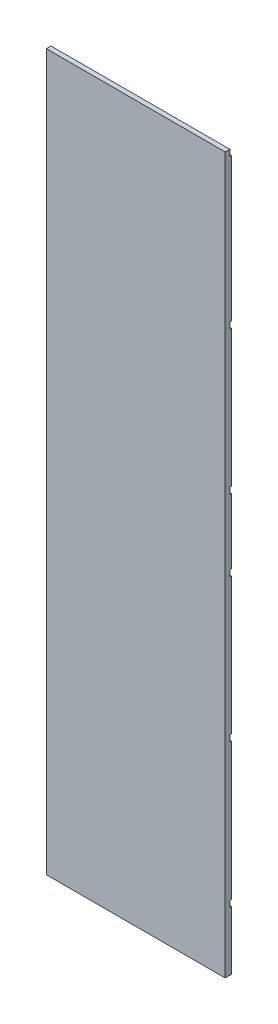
ISO-10303-21;
HEADER;
FILE_DESCRIPTION(('STEP AP214'),'2;1');
FILE_NAME('part.step','',(''),(''),'','','');
FILE_SCHEMA(('AUTOMOTIVE_DESIGN { 1 0 10303 214 1 1 1 1 }'));
ENDSEC;
DATA;
#1=APPLICATION_CONTEXT('core data for automotive mechanical design processes');
#2=APPLICATION_PROTOCOL_DEFINITION('international standard','automotive_design',2000,#1);
#3=PRODUCT_CONTEXT('',#1,'mechanical');
#4=PRODUCT('Part','Part','',(#3));
#5=PRODUCT_RELATED_PRODUCT_CATEGORY('part','',(#4));
#6=PRODUCT_DEFINITION_FORMATION('','',#4);
#7=PRODUCT_DEFINITION_CONTEXT('part definition',#1,'design');
#8=PRODUCT_DEFINITION('design','',#6,#7);
#9=PRODUCT_DEFINITION_SHAPE('','',#8);
#10=(LENGTH_UNIT() NAMED_UNIT(*) SI_UNIT(.MILLI.,.METRE.));
#11=(NAMED_UNIT(*) PLANE_ANGLE_UNIT() SI_UNIT($,.RADIAN.));
#12=(NAMED_UNIT(*) SI_UNIT($,.STERADIAN.) SOLID_ANGLE_UNIT());
#13=UNCERTAINTY_MEASURE_WITH_UNIT(LENGTH_MEASURE(1.E-05),#10,'distance_accuracy_value','');
#14=(GEOMETRIC_REPRESENTATION_CONTEXT(3) GLOBAL_UNCERTAINTY_ASSIGNED_CONTEXT((#13)) GLOBAL_UNIT_ASSIGNED_CONTEXT((#10,
#11,#12)) REPRESENTATION_CONTEXT('',''));
#15=CARTESIAN_POINT('',(0.,0.,0.));
#16=DIRECTION('',(0.,0.,1.));
#17=DIRECTION('',(1.,0.,0.));
#18=AXIS2_PLACEMENT_3D('',#15,#16,#17);
#19=CARTESIAN_POINT('',(0.,0.,1018.));
#20=DIRECTION('',(0.,0.,-1.));
#21=DIRECTION('',(1.,0.,0.));
#22=AXIS2_PLACEMENT_3D('',#19,#20,#21);
#23=PLANE('',#22);
#24=DIRECTION('',(0.999950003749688,0.00999950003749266,0.));
#25=VECTOR('',#24,1.);
#26=CARTESIAN_POINT('',(-249.999999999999,558.999999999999,1018.));
#27=LINE('',#26,#25);
#28=CARTESIAN_POINT('',(-249.999999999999,558.999999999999,1018.));
#29=VERTEX_POINT('',#28);
#30=CARTESIAN_POINT('',(250.000000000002,563.999999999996,1018.));
#31=VERTEX_POINT('',#30);
#32=EDGE_CURVE('E226',#29,#31,#27,.T.);
#33=ORIENTED_EDGE('',*,*,#32,.T.);
#34=DIRECTION('',(0.,1.,0.));
#35=VECTOR('',#34,1.);
#36=CARTESIAN_POINT('',(250.000000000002,1000.,1018.));
#37=LINE('',#36,#35);
#38=CARTESIAN_POINT('',(250.000000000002,181.999999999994,1018.));
#39=VERTEX_POINT('',#38);
#40=EDGE_CURVE('E440',#39,#31,#37,.T.);
#41=ORIENTED_EDGE('',*,*,#40,.F.);
#42=DIRECTION('',(-0.999950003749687,-0.00999950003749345,0.));
#43=VECTOR('',#42,1.);
#44=CARTESIAN_POINT('',(250.000000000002,181.999999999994,1018.));
#45=LINE('',#44,#43);
#46=CARTESIAN_POINT('',(-249.999999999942,176.999999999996,1018.));
#47=VERTEX_POINT('',#46);
#48=EDGE_CURVE('E250',#39,#47,#45,.T.);
#49=ORIENTED_EDGE('',*,*,#48,.T.);
#50=DIRECTION('',(0.,-1.,0.));
#51=VECTOR('',#50,1.);
#52=CARTESIAN_POINT('',(-249.999999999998,1000.,1018.));
#53=LINE('',#52,#51);
#54=EDGE_CURVE('E355',#29,#47,#53,.T.);
#55=ORIENTED_EDGE('',*,*,#54,.F.);
#56=EDGE_LOOP('',(#33,#41,#49,#55));
#57=FACE_BOUND('',#56,.T.);
#58=ADVANCED_FACE('F32',(#57),#23,.T.);
#59=DIRECTION('',(0.999950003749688,0.00999950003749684,0.));
#60=VECTOR('',#59,1.);
#61=CARTESIAN_POINT('',(-249.999999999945,158.999999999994,1018.));
#62=LINE('',#61,#60);
#63=CARTESIAN_POINT('',(-249.999999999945,158.999999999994,1018.));
#64=VERTEX_POINT('',#63);
#65=CARTESIAN_POINT('',(250.000000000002,163.999999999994,1018.));
#66=VERTEX_POINT('',#65);
#67=EDGE_CURVE('E243',#64,#66,#62,.T.);
#68=ORIENTED_EDGE('',*,*,#67,.T.);
#69=CARTESIAN_POINT('',(250.000000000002,-18.0000000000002,1018.));
#70=VERTEX_POINT('',#69);
#71=EDGE_CURVE('E438',#70,#66,#37,.T.);
#72=ORIENTED_EDGE('',*,*,#71,.F.);
#73=DIRECTION('',(-0.999950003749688,-0.00999950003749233,0.));
#74=VECTOR('',#73,1.);
#75=CARTESIAN_POINT('',(250.000000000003,-18.0000000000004,1018.));
#76=LINE('',#75,#74);
#77=CARTESIAN_POINT('',(-249.999999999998,-22.9999999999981,1018.));
#78=VERTEX_POINT('',#77);
#79=EDGE_CURVE('E274',#70,#78,#76,.T.);
#80=ORIENTED_EDGE('',*,*,#79,.T.);
#81=EDGE_CURVE('E464',#64,#78,#53,.T.);
#82=ORIENTED_EDGE('',*,*,#81,.F.);
#83=EDGE_LOOP('',(#68,#72,#80,#82));
#84=FACE_BOUND('',#83,.T.);
#85=ADVANCED_FACE('F479',(#84),#23,.T.);
#86=DIRECTION('',(0.999950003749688,0.00999950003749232,0.));
#87=VECTOR('',#86,1.);
#88=CARTESIAN_POINT('',(-249.999999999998,-40.9999999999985,1018.));
#89=LINE('',#88,#87);
#90=CARTESIAN_POINT('',(-249.999999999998,-40.9999999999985,1018.));
#91=VERTEX_POINT('',#90);
#92=CARTESIAN_POINT('',(250.000000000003,-36.0000000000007,1018.));
#93=VERTEX_POINT('',#92);
#94=EDGE_CURVE('E266',#91,#93,#89,.T.);
#95=ORIENTED_EDGE('',*,*,#94,.T.);
#96=CARTESIAN_POINT('',(250.000000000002,-418.000000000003,1018.));
#97=VERTEX_POINT('',#96);
#98=EDGE_CURVE('E413',#97,#93,#37,.T.);
#99=ORIENTED_EDGE('',*,*,#98,.F.);
#100=DIRECTION('',(-0.999950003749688,-0.0099995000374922,0.));
#101=VECTOR('',#100,1.);
#102=CARTESIAN_POINT('',(250.000000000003,-418.000000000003,1018.));
#103=LINE('',#102,#101);
#104=CARTESIAN_POINT('',(-249.999999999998,-423.000000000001,1018.));
#105=VERTEX_POINT('',#104);
#106=EDGE_CURVE('E298',#97,#105,#103,.T.);
#107=ORIENTED_EDGE('',*,*,#106,.T.);
#108=EDGE_CURVE('E704',#91,#105,#53,.T.);
#109=ORIENTED_EDGE('',*,*,#108,.F.);
#110=EDGE_LOOP('',(#95,#99,#107,#109));
#111=FACE_BOUND('',#110,.T.);
#112=ADVANCED_FACE('F436',(#111),#23,.T.);
#113=DIRECTION('',(0.999950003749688,0.0099995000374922,0.));
#114=VECTOR('',#113,1.);
#115=CARTESIAN_POINT('',(-249.999999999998,-441.000000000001,1018.));
#116=LINE('',#115,#114);
#117=CARTESIAN_POINT('',(-249.999999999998,-441.000000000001,1018.));
#118=VERTEX_POINT('',#117);
#119=CARTESIAN_POINT('',(250.000000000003,-436.000000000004,1018.));
#120=VERTEX_POINT('',#119);
#121=EDGE_CURVE('E290',#118,#120,#116,.T.);
#122=ORIENTED_EDGE('',*,*,#121,.T.);
#123=CARTESIAN_POINT('',(250.000000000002,-818.000000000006,1018.));
#124=VERTEX_POINT('',#123);
#125=EDGE_CURVE('E364',#124,#120,#37,.T.);
#126=ORIENTED_EDGE('',*,*,#125,.F.);
#127=DIRECTION('',(-0.999950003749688,-0.00999950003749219,0.));
#128=VECTOR('',#127,1.);
#129=CARTESIAN_POINT('',(250.000000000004,-818.000000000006,1018.));
#130=LINE('',#129,#128);
#131=CARTESIAN_POINT('',(-249.999999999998,-823.000000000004,1018.));
#132=VERTEX_POINT('',#131);
#133=EDGE_CURVE('E322',#124,#132,#130,.T.);
#134=ORIENTED_EDGE('',*,*,#133,.T.);
#135=EDGE_CURVE('E395',#118,#132,#53,.T.);
#136=ORIENTED_EDGE('',*,*,#135,.F.);
#137=EDGE_LOOP('',(#122,#126,#134,#136));
#138=FACE_BOUND('',#137,.T.);
#139=ADVANCED_FACE('F416',(#138),#23,.T.);
#140=DIRECTION('',(0.999950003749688,0.00999950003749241,0.));
#141=VECTOR('',#140,1.);
#142=CARTESIAN_POINT('',(-249.999999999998,-841.000000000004,1018.));
#143=LINE('',#142,#141);
#144=CARTESIAN_POINT('',(-249.999999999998,-841.000000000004,1018.));
#145=VERTEX_POINT('',#144);
#146=CARTESIAN_POINT('',(250.000000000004,-836.000000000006,1018.));
#147=VERTEX_POINT('',#146);
#148=EDGE_CURVE('E314',#145,#147,#143,.T.);
#149=ORIENTED_EDGE('',*,*,#148,.T.);
#150=CARTESIAN_POINT('',(250.000000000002,-1000.,1018.));
#151=VERTEX_POINT('',#150);
#152=EDGE_CURVE('E360',#151,#147,#37,.T.);
#153=ORIENTED_EDGE('',*,*,#152,.F.);
#154=DIRECTION('',(1.,0.,0.));
#155=VECTOR('',#154,1.);
#156=CARTESIAN_POINT('',(-249.999999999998,-1000.,1018.));
#157=LINE('',#156,#155);
#158=CARTESIAN_POINT('',(-249.999999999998,-1000.,1018.));
#159=VERTEX_POINT('',#158);
#160=EDGE_CURVE('E354',#159,#151,#157,.T.);
#161=ORIENTED_EDGE('',*,*,#160,.F.);
#162=EDGE_CURVE('E356',#145,#159,#53,.T.);
#163=ORIENTED_EDGE('',*,*,#162,.F.);
#164=EDGE_LOOP('',(#149,#153,#161,#163));
#165=FACE_BOUND('',#164,.T.);
#166=ADVANCED_FACE('F396',(#165),#23,.T.);
#167=CARTESIAN_POINT('',(-249.999999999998,1000.,1018.));
#168=DIRECTION('',(0.,-1.,0.));
#169=DIRECTION('',(0.,0.,1.));
#170=AXIS2_PLACEMENT_3D('',#167,#168,#169);
#171=PLANE('',#170);
#172=DIRECTION('',(-1.,0.,0.));
#173=VECTOR('',#172,1.);
#174=CARTESIAN_POINT('',(250.000000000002,1000.,1023.));
#175=LINE('',#174,#173);
#176=CARTESIAN_POINT('',(250.000000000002,1000.,1023.));
#177=VERTEX_POINT('',#176);
#178=CARTESIAN_POINT('',(-249.999999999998,1000.,1023.));
#179=VERTEX_POINT('',#178);
#180=EDGE_CURVE('E335',#177,#179,#175,.T.);
#181=ORIENTED_EDGE('',*,*,#180,.T.);
#182=DIRECTION('',(0.,0.,1.));
#183=VECTOR('',#182,1.);
#184=CARTESIAN_POINT('',(-249.999999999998,1000.,1018.));
#185=LINE('',#184,#183);
#186=CARTESIAN_POINT('',(-249.999999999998,1000.,1036.));
#187=VERTEX_POINT('',#186);
#188=EDGE_CURVE('E363',#179,#187,#185,.T.);
#189=ORIENTED_EDGE('',*,*,#188,.T.);
#190=DIRECTION('',(-1.,0.,0.));
#191=VECTOR('',#190,1.);
#192=CARTESIAN_POINT('',(-249.999999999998,1000.,1036.));
#193=LINE('',#192,#191);
#194=CARTESIAN_POINT('',(250.000000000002,1000.,1036.));
#195=VERTEX_POINT('',#194);
#196=EDGE_CURVE('E372',#195,#187,#193,.T.);
#197=ORIENTED_EDGE('',*,*,#196,.F.);
#198=DIRECTION('',(0.,0.,1.));
#199=VECTOR('',#198,1.);
#200=CARTESIAN_POINT('',(250.000000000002,1000.,1018.));
#201=LINE('',#200,#199);
#202=EDGE_CURVE('E377',#177,#195,#201,.T.);
#203=ORIENTED_EDGE('',*,*,#202,.F.);
#204=EDGE_LOOP('',(#181,#189,#197,#203));
#205=FACE_BOUND('',#204,.T.);
#206=ADVANCED_FACE('F457',(#205),#171,.F.);
#207=CARTESIAN_POINT('',(-249.999999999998,1000.,1018.));
#208=DIRECTION('',(1.,0.,0.));
#209=DIRECTION('',(0.,0.,1.));
#210=AXIS2_PLACEMENT_3D('',#207,#208,#209);
#211=PLANE('',#210);
#212=ORIENTED_EDGE('',*,*,#54,.T.);
#213=DIRECTION('',(0.,0.,-1.));
#214=VECTOR('',#213,1.);
#215=CARTESIAN_POINT('',(-249.999999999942,176.999999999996,1023.));
#216=LINE('',#215,#214);
#217=CARTESIAN_POINT('',(-249.999999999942,176.999999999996,1023.));
#218=VERTEX_POINT('',#217);
#219=EDGE_CURVE('E259',#218,#47,#216,.T.);
#220=ORIENTED_EDGE('',*,*,#219,.F.);
#221=DIRECTION('',(-1.54197642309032E-13,-1.,0.));
#222=VECTOR('',#221,1.);
#223=CARTESIAN_POINT('',(-249.999999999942,176.999999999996,1023.));
#224=LINE('',#223,#222);
#225=CARTESIAN_POINT('',(-249.999999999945,158.999999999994,1023.));
#226=VERTEX_POINT('',#225);
#227=EDGE_CURVE('E245',#218,#226,#224,.T.);
#228=ORIENTED_EDGE('',*,*,#227,.T.);
#229=DIRECTION('',(0.,0.,-1.));
#230=VECTOR('',#229,1.);
#231=CARTESIAN_POINT('',(-249.999999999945,158.999999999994,1023.));
#232=LINE('',#231,#230);
#233=EDGE_CURVE('E257',#226,#64,#232,.T.);
#234=ORIENTED_EDGE('',*,*,#233,.T.);
#235=ORIENTED_EDGE('',*,*,#81,.T.);
#236=DIRECTION('',(0.,0.,-1.));
#237=VECTOR('',#236,1.);
#238=CARTESIAN_POINT('',(-249.999999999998,-22.9999999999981,1023.));
#239=LINE('',#238,#237);
#240=CARTESIAN_POINT('',(-249.999999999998,-22.9999999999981,1023.));
#241=VERTEX_POINT('',#240);
#242=EDGE_CURVE('E283',#241,#78,#239,.T.);
#243=ORIENTED_EDGE('',*,*,#242,.F.);
#244=DIRECTION('',(0.,-1.,0.));
#245=VECTOR('',#244,1.);
#246=CARTESIAN_POINT('',(-249.999999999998,-22.9999999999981,1023.));
#247=LINE('',#246,#245);
#248=CARTESIAN_POINT('',(-249.999999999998,-40.9999999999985,1023.));
#249=VERTEX_POINT('',#248);
#250=EDGE_CURVE('E268',#241,#249,#247,.T.);
#251=ORIENTED_EDGE('',*,*,#250,.T.);
#252=DIRECTION('',(0.,0.,-1.));
#253=VECTOR('',#252,1.);
#254=CARTESIAN_POINT('',(-249.999999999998,-40.9999999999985,1023.));
#255=LINE('',#254,#253);
#256=EDGE_CURVE('E281',#249,#91,#255,.T.);
#257=ORIENTED_EDGE('',*,*,#256,.T.);
#258=ORIENTED_EDGE('',*,*,#108,.T.);
#259=DIRECTION('',(0.,0.,-1.));
#260=VECTOR('',#259,1.);
#261=CARTESIAN_POINT('',(-249.999999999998,-423.000000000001,1023.));
#262=LINE('',#261,#260);
#263=CARTESIAN_POINT('',(-249.999999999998,-423.000000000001,1023.));
#264=VERTEX_POINT('',#263);
#265=EDGE_CURVE('E307',#264,#105,#262,.T.);
#266=ORIENTED_EDGE('',*,*,#265,.F.);
#267=DIRECTION('',(0.,-1.,0.));
#268=VECTOR('',#267,1.);
#269=CARTESIAN_POINT('',(-249.999999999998,-423.000000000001,1023.));
#270=LINE('',#269,#268);
#271=CARTESIAN_POINT('',(-249.999999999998,-441.000000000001,1023.));
#272=VERTEX_POINT('',#271);
#273=EDGE_CURVE('E292',#264,#272,#270,.T.);
#274=ORIENTED_EDGE('',*,*,#273,.T.);
#275=DIRECTION('',(0.,0.,-1.));
#276=VECTOR('',#275,1.);
#277=CARTESIAN_POINT('',(-249.999999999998,-441.000000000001,1023.));
#278=LINE('',#277,#276);
#279=EDGE_CURVE('E305',#272,#118,#278,.T.);
#280=ORIENTED_EDGE('',*,*,#279,.T.);
#281=ORIENTED_EDGE('',*,*,#135,.T.);
#282=DIRECTION('',(0.,0.,-1.));
#283=VECTOR('',#282,1.);
#284=CARTESIAN_POINT('',(-249.999999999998,-823.000000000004,1023.));
#285=LINE('',#284,#283);
#286=CARTESIAN_POINT('',(-249.999999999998,-823.000000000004,1023.));
#287=VERTEX_POINT('',#286);
#288=EDGE_CURVE('E330',#287,#132,#285,.T.);
#289=ORIENTED_EDGE('',*,*,#288,.F.);
#290=DIRECTION('',(0.,-1.,0.));
#291=VECTOR('',#290,1.);
#292=CARTESIAN_POINT('',(-249.999999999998,-823.000000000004,1023.));
#293=LINE('',#292,#291);
#294=CARTESIAN_POINT('',(-249.999999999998,-841.000000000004,1023.));
#295=VERTEX_POINT('',#294);
#296=EDGE_CURVE('E316',#287,#295,#293,.T.);
#297=ORIENTED_EDGE('',*,*,#296,.T.);
#298=DIRECTION('',(0.,0.,-1.));
#299=VECTOR('',#298,1.);
#300=CARTESIAN_POINT('',(-249.999999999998,-841.000000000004,1023.));
#301=LINE('',#300,#299);
#302=EDGE_CURVE('E328',#295,#145,#301,.T.);
#303=ORIENTED_EDGE('',*,*,#302,.T.);
#304=ORIENTED_EDGE('',*,*,#162,.T.);
#305=DIRECTION('',(0.,0.,1.));
#306=VECTOR('',#305,1.);
#307=CARTESIAN_POINT('',(-249.999999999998,-1000.,1018.));
#308=LINE('',#307,#306);
#309=CARTESIAN_POINT('',(-249.999999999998,-1000.,1036.));
#310=VERTEX_POINT('',#309);
#311=EDGE_CURVE('E11',#159,#310,#308,.T.);
#312=ORIENTED_EDGE('',*,*,#311,.T.);
#313=DIRECTION('',(0.,-1.,0.));
#314=VECTOR('',#313,1.);
#315=CARTESIAN_POINT('',(-249.999999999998,1000.,1036.));
#316=LINE('',#315,#314);
#317=EDGE_CURVE('E348',#187,#310,#316,.T.);
#318=ORIENTED_EDGE('',*,*,#317,.F.);
#319=ORIENTED_EDGE('',*,*,#188,.F.);
#320=DIRECTION('',(0.,-1.,0.));
#321=VECTOR('',#320,1.);
#322=CARTESIAN_POINT('',(-249.999999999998,1000.,1023.));
#323=LINE('',#322,#321);
#324=CARTESIAN_POINT('',(-249.999999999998,982.,1023.));
#325=VERTEX_POINT('',#324);
#326=EDGE_CURVE('E338',#179,#325,#323,.T.);
#327=ORIENTED_EDGE('',*,*,#326,.T.);
#328=DIRECTION('',(0.,0.,-1.));
#329=VECTOR('',#328,1.);
#330=CARTESIAN_POINT('',(-249.999999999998,982.,1023.));
#331=LINE('',#330,#329);
#332=CARTESIAN_POINT('',(-249.999999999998,982.,1018.));
#333=VERTEX_POINT('',#332);
#334=EDGE_CURVE('E343',#325,#333,#331,.T.);
#335=ORIENTED_EDGE('',*,*,#334,.T.);
#336=CARTESIAN_POINT('',(-249.999999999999,576.999999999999,1018.));
#337=VERTEX_POINT('',#336);
#338=EDGE_CURVE('E351',#333,#337,#53,.T.);
#339=ORIENTED_EDGE('',*,*,#338,.T.);
#340=DIRECTION('',(0.,0.,-1.));
#341=VECTOR('',#340,1.);
#342=CARTESIAN_POINT('',(-249.999999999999,576.999999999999,1023.));
#343=LINE('',#342,#341);
#344=CARTESIAN_POINT('',(-249.999999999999,576.999999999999,1023.));
#345=VERTEX_POINT('',#344);
#346=EDGE_CURVE('E220',#345,#337,#343,.T.);
#347=ORIENTED_EDGE('',*,*,#346,.F.);
#348=DIRECTION('',(0.,-1.,0.));
#349=VECTOR('',#348,1.);
#350=CARTESIAN_POINT('',(-249.999999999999,576.999999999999,1023.));
#351=LINE('',#350,#349);
#352=CARTESIAN_POINT('',(-249.999999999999,558.999999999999,1023.));
#353=VERTEX_POINT('',#352);
#354=EDGE_CURVE('E213',#345,#353,#351,.T.);
#355=ORIENTED_EDGE('',*,*,#354,.T.);
#356=DIRECTION('',(0.,0.,-1.));
#357=VECTOR('',#356,1.);
#358=CARTESIAN_POINT('',(-249.999999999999,558.999999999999,1023.));
#359=LINE('',#358,#357);
#360=EDGE_CURVE('E237',#353,#29,#359,.T.);
#361=ORIENTED_EDGE('',*,*,#360,.T.);
#362=EDGE_LOOP('',(#212,#220,#228,#234,#235,#243,#251,#257,#258,#266,#274,#280,#281,#289,#297,
#303,#304,#312,#318,#319,#327,#335,#339,#347,#355,#361));
#363=FACE_BOUND('',#362,.T.);
#364=ADVANCED_FACE('F34',(#363),#211,.F.);
#365=CARTESIAN_POINT('',(-249.999999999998,-1000.,1018.));
#366=DIRECTION('',(0.,1.,0.));
#367=DIRECTION('',(0.,0.,-1.));
#368=AXIS2_PLACEMENT_3D('',#365,#366,#367);
#369=PLANE('',#368);
#370=DIRECTION('',(1.,0.,0.));
#371=VECTOR('',#370,1.);
#372=CARTESIAN_POINT('',(-249.999999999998,-1000.,1036.));
#373=LINE('',#372,#371);
#374=CARTESIAN_POINT('',(250.000000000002,-1000.,1036.));
#375=VERTEX_POINT('',#374);
#376=EDGE_CURVE('E367',#310,#375,#373,.T.);
#377=ORIENTED_EDGE('',*,*,#376,.F.);
#378=ORIENTED_EDGE('',*,*,#311,.F.);
#379=ORIENTED_EDGE('',*,*,#160,.T.);
#380=DIRECTION('',(0.,0.,1.));
#381=VECTOR('',#380,1.);
#382=CARTESIAN_POINT('',(250.000000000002,-1000.,1018.));
#383=LINE('',#382,#381);
#384=EDGE_CURVE('E40',#151,#375,#383,.T.);
#385=ORIENTED_EDGE('',*,*,#384,.T.);
#386=EDGE_LOOP('',(#377,#378,#379,#385));
#387=FACE_BOUND('',#386,.T.);
#388=ADVANCED_FACE('F381',(#387),#369,.F.);
#389=CARTESIAN_POINT('',(250.000000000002,1000.,1018.));
#390=DIRECTION('',(-1.,0.,0.));
#391=DIRECTION('',(0.,0.,-1.));
#392=AXIS2_PLACEMENT_3D('',#389,#390,#391);
#393=PLANE('',#392);
#394=DIRECTION('',(0.,1.,0.));
#395=VECTOR('',#394,1.);
#396=CARTESIAN_POINT('',(250.000000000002,563.999999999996,1023.));
#397=LINE('',#396,#395);
#398=CARTESIAN_POINT('',(250.000000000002,563.999999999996,1023.));
#399=VERTEX_POINT('',#398);
#400=CARTESIAN_POINT('',(250.000000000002,581.999999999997,1023.));
#401=VERTEX_POINT('',#400);
#402=EDGE_CURVE('E211',#399,#401,#397,.T.);
#403=ORIENTED_EDGE('',*,*,#402,.T.);
#404=DIRECTION('',(0.,0.,-1.));
#405=VECTOR('',#404,1.);
#406=CARTESIAN_POINT('',(250.000000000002,581.999999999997,1023.));
#407=LINE('',#406,#405);
#408=CARTESIAN_POINT('',(250.000000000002,581.999999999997,1018.));
#409=VERTEX_POINT('',#408);
#410=EDGE_CURVE('E217',#401,#409,#407,.T.);
#411=ORIENTED_EDGE('',*,*,#410,.T.);
#412=CARTESIAN_POINT('',(250.000000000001,982.,1018.));
#413=VERTEX_POINT('',#412);
#414=EDGE_CURVE('E359',#409,#413,#37,.T.);
#415=ORIENTED_EDGE('',*,*,#414,.T.);
#416=DIRECTION('',(0.,0.,-1.));
#417=VECTOR('',#416,1.);
#418=CARTESIAN_POINT('',(250.000000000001,982.,1023.));
#419=LINE('',#418,#417);
#420=CARTESIAN_POINT('',(250.000000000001,982.,1023.));
#421=VERTEX_POINT('',#420);
#422=EDGE_CURVE('E345',#421,#413,#419,.T.);
#423=ORIENTED_EDGE('',*,*,#422,.F.);
#424=DIRECTION('',(0.,1.,0.));
#425=VECTOR('',#424,1.);
#426=CARTESIAN_POINT('',(250.000000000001,982.,1023.));
#427=LINE('',#426,#425);
#428=EDGE_CURVE('E333',#421,#177,#427,.T.);
#429=ORIENTED_EDGE('',*,*,#428,.T.);
#430=ORIENTED_EDGE('',*,*,#202,.T.);
#431=DIRECTION('',(0.,1.,0.));
#432=VECTOR('',#431,1.);
#433=CARTESIAN_POINT('',(250.000000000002,1000.,1036.));
#434=LINE('',#433,#432);
#435=EDGE_CURVE('E370',#375,#195,#434,.T.);
#436=ORIENTED_EDGE('',*,*,#435,.F.);
#437=ORIENTED_EDGE('',*,*,#384,.F.);
#438=ORIENTED_EDGE('',*,*,#152,.T.);
#439=DIRECTION('',(0.,0.,-1.));
#440=VECTOR('',#439,1.);
#441=CARTESIAN_POINT('',(250.000000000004,-836.000000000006,1023.));
#442=LINE('',#441,#440);
#443=CARTESIAN_POINT('',(250.000000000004,-836.000000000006,1023.));
#444=VERTEX_POINT('',#443);
#445=EDGE_CURVE('E301',#444,#147,#442,.T.);
#446=ORIENTED_EDGE('',*,*,#445,.F.);
#447=DIRECTION('',(0.,1.,0.));
#448=VECTOR('',#447,1.);
#449=CARTESIAN_POINT('',(250.000000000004,-836.000000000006,1023.));
#450=LINE('',#449,#448);
#451=CARTESIAN_POINT('',(250.000000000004,-818.000000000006,1023.));
#452=VERTEX_POINT('',#451);
#453=EDGE_CURVE('E310',#444,#452,#450,.T.);
#454=ORIENTED_EDGE('',*,*,#453,.T.);
#455=DIRECTION('',(0.,0.,-1.));
#456=VECTOR('',#455,1.);
#457=CARTESIAN_POINT('',(250.000000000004,-818.000000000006,1023.));
#458=LINE('',#457,#456);
#459=EDGE_CURVE('E321',#452,#124,#458,.T.);
#460=ORIENTED_EDGE('',*,*,#459,.T.);
#461=ORIENTED_EDGE('',*,*,#125,.T.);
#462=DIRECTION('',(0.,0.,-1.));
#463=VECTOR('',#462,1.);
#464=CARTESIAN_POINT('',(250.000000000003,-436.000000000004,1023.));
#465=LINE('',#464,#463);
#466=CARTESIAN_POINT('',(250.000000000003,-436.000000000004,1023.));
#467=VERTEX_POINT('',#466);
#468=EDGE_CURVE('E277',#467,#120,#465,.T.);
#469=ORIENTED_EDGE('',*,*,#468,.F.);
#470=DIRECTION('',(0.,1.,0.));
#471=VECTOR('',#470,1.);
#472=CARTESIAN_POINT('',(250.000000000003,-436.000000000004,1023.));
#473=LINE('',#472,#471);
#474=CARTESIAN_POINT('',(250.000000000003,-418.000000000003,1023.));
#475=VERTEX_POINT('',#474);
#476=EDGE_CURVE('E286',#467,#475,#473,.T.);
#477=ORIENTED_EDGE('',*,*,#476,.T.);
#478=DIRECTION('',(0.,0.,-1.));
#479=VECTOR('',#478,1.);
#480=CARTESIAN_POINT('',(250.000000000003,-418.000000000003,1023.));
#481=LINE('',#480,#479);
#482=EDGE_CURVE('E297',#475,#97,#481,.T.);
#483=ORIENTED_EDGE('',*,*,#482,.T.);
#484=ORIENTED_EDGE('',*,*,#98,.T.);
#485=DIRECTION('',(0.,0.,-1.));
#486=VECTOR('',#485,1.);
#487=CARTESIAN_POINT('',(250.000000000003,-36.0000000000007,1023.));
#488=LINE('',#487,#486);
#489=CARTESIAN_POINT('',(250.000000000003,-36.0000000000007,1023.));
#490=VERTEX_POINT('',#489);
#491=EDGE_CURVE('E253',#490,#93,#488,.T.);
#492=ORIENTED_EDGE('',*,*,#491,.F.);
#493=DIRECTION('',(0.,1.,0.));
#494=VECTOR('',#493,1.);
#495=CARTESIAN_POINT('',(250.000000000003,-36.0000000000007,1023.));
#496=LINE('',#495,#494);
#497=CARTESIAN_POINT('',(250.000000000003,-18.0000000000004,1023.));
#498=VERTEX_POINT('',#497);
#499=EDGE_CURVE('E262',#490,#498,#496,.T.);
#500=ORIENTED_EDGE('',*,*,#499,.T.);
#501=DIRECTION('',(0.,0.,-1.));
#502=VECTOR('',#501,1.);
#503=CARTESIAN_POINT('',(250.000000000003,-18.0000000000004,1023.));
#504=LINE('',#503,#502);
#505=EDGE_CURVE('E273',#498,#70,#504,.T.);
#506=ORIENTED_EDGE('',*,*,#505,.T.);
#507=ORIENTED_EDGE('',*,*,#71,.T.);
#508=DIRECTION('',(0.,0.,-1.));
#509=VECTOR('',#508,1.);
#510=CARTESIAN_POINT('',(250.000000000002,163.999999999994,1023.));
#511=LINE('',#510,#509);
#512=CARTESIAN_POINT('',(250.000000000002,163.999999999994,1023.));
#513=VERTEX_POINT('',#512);
#514=EDGE_CURVE('E233',#513,#66,#511,.T.);
#515=ORIENTED_EDGE('',*,*,#514,.F.);
#516=DIRECTION('',(0.,1.,0.));
#517=VECTOR('',#516,1.);
#518=CARTESIAN_POINT('',(250.000000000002,163.999999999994,1023.));
#519=LINE('',#518,#517);
#520=CARTESIAN_POINT('',(250.000000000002,181.999999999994,1023.));
#521=VERTEX_POINT('',#520);
#522=EDGE_CURVE('E240',#513,#521,#519,.T.);
#523=ORIENTED_EDGE('',*,*,#522,.T.);
#524=DIRECTION('',(0.,0.,-1.));
#525=VECTOR('',#524,1.);
#526=CARTESIAN_POINT('',(250.000000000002,181.999999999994,1023.));
#527=LINE('',#526,#525);
#528=EDGE_CURVE('E55',#521,#39,#527,.T.);
#529=ORIENTED_EDGE('',*,*,#528,.T.);
#530=ORIENTED_EDGE('',*,*,#40,.T.);
#531=DIRECTION('',(0.,0.,-1.));
#532=VECTOR('',#531,1.);
#533=CARTESIAN_POINT('',(250.000000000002,563.999999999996,1023.));
#534=LINE('',#533,#532);
#535=EDGE_CURVE('E225',#399,#31,#534,.T.);
#536=ORIENTED_EDGE('',*,*,#535,.F.);
#537=EDGE_LOOP('',(#403,#411,#415,#423,#429,#430,#436,#437,#438,#446,#454,#460,#461,#469,#477,
#483,#484,#492,#500,#506,#507,#515,#523,#529,#530,#536));
#538=FACE_BOUND('',#537,.T.);
#539=ADVANCED_FACE('F224',(#538),#393,.F.);
#540=DIRECTION('',(-0.999950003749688,-0.00999950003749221,0.));
#541=VECTOR('',#540,1.);
#542=CARTESIAN_POINT('',(250.000000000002,581.999999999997,1018.));
#543=LINE('',#542,#541);
#544=EDGE_CURVE('E47',#409,#337,#543,.T.);
#545=ORIENTED_EDGE('',*,*,#544,.T.);
#546=ORIENTED_EDGE('',*,*,#338,.F.);
#547=DIRECTION('',(1.,0.,0.));
#548=VECTOR('',#547,1.);
#549=CARTESIAN_POINT('',(-249.999999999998,982.,1018.));
#550=LINE('',#549,#548);
#551=EDGE_CURVE('E236',#333,#413,#550,.T.);
#552=ORIENTED_EDGE('',*,*,#551,.T.);
#553=ORIENTED_EDGE('',*,*,#414,.F.);
#554=EDGE_LOOP('',(#545,#546,#552,#553));
#555=FACE_BOUND('',#554,.T.);
#556=ADVANCED_FACE('F446',(#555),#23,.T.);
#557=CARTESIAN_POINT('',(0.,0.,1036.));
#558=DIRECTION('',(0.,0.,-1.));
#559=DIRECTION('',(1.,0.,0.));
#560=AXIS2_PLACEMENT_3D('',#557,#558,#559);
#561=PLANE('',#560);
#562=ORIENTED_EDGE('',*,*,#317,.T.);
#563=ORIENTED_EDGE('',*,*,#376,.T.);
#564=ORIENTED_EDGE('',*,*,#435,.T.);
#565=ORIENTED_EDGE('',*,*,#196,.T.);
#566=EDGE_LOOP('',(#562,#563,#564,#565));
#567=FACE_BOUND('',#566,.T.);
#568=ADVANCED_FACE('F385',(#567),#561,.F.);
#569=CARTESIAN_POINT('',(-249.999999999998,982.,1023.));
#570=DIRECTION('',(0.,-1.,0.));
#571=DIRECTION('',(0.,0.,1.));
#572=AXIS2_PLACEMENT_3D('',#569,#570,#571);
#573=PLANE('',#572);
#574=ORIENTED_EDGE('',*,*,#551,.F.);
#575=ORIENTED_EDGE('',*,*,#334,.F.);
#576=DIRECTION('',(1.,0.,0.));
#577=VECTOR('',#576,1.);
#578=CARTESIAN_POINT('',(-249.999999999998,982.,1023.));
#579=LINE('',#578,#577);
#580=EDGE_CURVE('E341',#325,#421,#579,.T.);
#581=ORIENTED_EDGE('',*,*,#580,.T.);
#582=ORIENTED_EDGE('',*,*,#422,.T.);
#583=EDGE_LOOP('',(#574,#575,#581,#582));
#584=FACE_BOUND('',#583,.T.);
#585=ADVANCED_FACE('F450',(#584),#573,.F.);
#586=CARTESIAN_POINT('',(0.,0.,1023.));
#587=DIRECTION('',(0.,0.,-1.));
#588=DIRECTION('',(1.,0.,0.));
#589=AXIS2_PLACEMENT_3D('',#586,#587,#588);
#590=PLANE('',#589);
#591=ORIENTED_EDGE('',*,*,#428,.F.);
#592=ORIENTED_EDGE('',*,*,#580,.F.);
#593=ORIENTED_EDGE('',*,*,#326,.F.);
#594=ORIENTED_EDGE('',*,*,#180,.F.);
#595=EDGE_LOOP('',(#591,#592,#593,#594));
#596=FACE_BOUND('',#595,.T.);
#597=ADVANCED_FACE('F454',(#596),#590,.T.);
#598=CARTESIAN_POINT('',(-249.999999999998,-841.000000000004,1023.));
#599=DIRECTION('',(0.00999950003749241,-0.999950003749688,0.));
#600=DIRECTION('',(0.999950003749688,0.00999950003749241,0.));
#601=AXIS2_PLACEMENT_3D('',#598,#599,#600);
#602=PLANE('',#601);
#603=ORIENTED_EDGE('',*,*,#148,.F.);
#604=ORIENTED_EDGE('',*,*,#302,.F.);
#605=DIRECTION('',(0.999950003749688,0.00999950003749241,0.));
#606=VECTOR('',#605,1.);
#607=CARTESIAN_POINT('',(-249.999999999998,-841.000000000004,1023.));
#608=LINE('',#607,#606);
#609=EDGE_CURVE('E319',#295,#444,#608,.T.);
#610=ORIENTED_EDGE('',*,*,#609,.T.);
#611=ORIENTED_EDGE('',*,*,#445,.T.);
#612=EDGE_LOOP('',(#603,#604,#610,#611));
#613=FACE_BOUND('',#612,.T.);
#614=ADVANCED_FACE('F400',(#613),#602,.F.);
#615=CARTESIAN_POINT('',(250.000000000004,-818.000000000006,1023.));
#616=DIRECTION('',(-0.00999950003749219,0.999950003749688,0.));
#617=DIRECTION('',(-0.999950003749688,-0.00999950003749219,0.));
#618=AXIS2_PLACEMENT_3D('',#615,#616,#617);
#619=PLANE('',#618);
#620=ORIENTED_EDGE('',*,*,#133,.F.);
#621=ORIENTED_EDGE('',*,*,#459,.F.);
#622=DIRECTION('',(-0.999950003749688,-0.00999950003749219,0.));
#623=VECTOR('',#622,1.);
#624=CARTESIAN_POINT('',(250.000000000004,-818.000000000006,1023.));
#625=LINE('',#624,#623);
#626=EDGE_CURVE('E313',#452,#287,#625,.T.);
#627=ORIENTED_EDGE('',*,*,#626,.T.);
#628=ORIENTED_EDGE('',*,*,#288,.T.);
#629=EDGE_LOOP('',(#620,#621,#627,#628));
#630=FACE_BOUND('',#629,.T.);
#631=ADVANCED_FACE('F408',(#630),#619,.F.);
#632=CARTESIAN_POINT('',(0.,0.,1023.));
#633=DIRECTION('',(0.,0.,-1.));
#634=DIRECTION('',(1.,0.,0.));
#635=AXIS2_PLACEMENT_3D('',#632,#633,#634);
#636=PLANE('',#635);
#637=ORIENTED_EDGE('',*,*,#453,.F.);
#638=ORIENTED_EDGE('',*,*,#609,.F.);
#639=ORIENTED_EDGE('',*,*,#296,.F.);
#640=ORIENTED_EDGE('',*,*,#626,.F.);
#641=EDGE_LOOP('',(#637,#638,#639,#640));
#642=FACE_BOUND('',#641,.T.);
#643=ADVANCED_FACE('F403',(#642),#636,.T.);
#644=CARTESIAN_POINT('',(-249.999999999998,-441.000000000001,1023.));
#645=DIRECTION('',(0.0099995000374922,-0.999950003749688,0.));
#646=DIRECTION('',(0.999950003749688,0.0099995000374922,0.));
#647=AXIS2_PLACEMENT_3D('',#644,#645,#646);
#648=PLANE('',#647);
#649=ORIENTED_EDGE('',*,*,#121,.F.);
#650=ORIENTED_EDGE('',*,*,#279,.F.);
#651=DIRECTION('',(0.999950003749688,0.0099995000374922,0.));
#652=VECTOR('',#651,1.);
#653=CARTESIAN_POINT('',(-249.999999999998,-441.000000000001,1023.));
#654=LINE('',#653,#652);
#655=EDGE_CURVE('E295',#272,#467,#654,.T.);
#656=ORIENTED_EDGE('',*,*,#655,.T.);
#657=ORIENTED_EDGE('',*,*,#468,.T.);
#658=EDGE_LOOP('',(#649,#650,#656,#657));
#659=FACE_BOUND('',#658,.T.);
#660=ADVANCED_FACE('F420',(#659),#648,.F.);
#661=CARTESIAN_POINT('',(250.000000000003,-418.000000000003,1023.));
#662=DIRECTION('',(-0.0099995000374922,0.999950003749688,0.));
#663=DIRECTION('',(-0.999950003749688,-0.0099995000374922,0.));
#664=AXIS2_PLACEMENT_3D('',#661,#662,#663);
#665=PLANE('',#664);
#666=ORIENTED_EDGE('',*,*,#106,.F.);
#667=ORIENTED_EDGE('',*,*,#482,.F.);
#668=DIRECTION('',(-0.999950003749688,-0.0099995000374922,0.));
#669=VECTOR('',#668,1.);
#670=CARTESIAN_POINT('',(250.000000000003,-418.000000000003,1023.));
#671=LINE('',#670,#669);
#672=EDGE_CURVE('E289',#475,#264,#671,.T.);
#673=ORIENTED_EDGE('',*,*,#672,.T.);
#674=ORIENTED_EDGE('',*,*,#265,.T.);
#675=EDGE_LOOP('',(#666,#667,#673,#674));
#676=FACE_BOUND('',#675,.T.);
#677=ADVANCED_FACE('F431',(#676),#665,.F.);
#678=CARTESIAN_POINT('',(0.,0.,1023.));
#679=DIRECTION('',(0.,0.,-1.));
#680=DIRECTION('',(1.,0.,0.));
#681=AXIS2_PLACEMENT_3D('',#678,#679,#680);
#682=PLANE('',#681);
#683=ORIENTED_EDGE('',*,*,#476,.F.);
#684=ORIENTED_EDGE('',*,*,#655,.F.);
#685=ORIENTED_EDGE('',*,*,#273,.F.);
#686=ORIENTED_EDGE('',*,*,#672,.F.);
#687=EDGE_LOOP('',(#683,#684,#685,#686));
#688=FACE_BOUND('',#687,.T.);
#689=ADVANCED_FACE('F424',(#688),#682,.T.);
#690=CARTESIAN_POINT('',(-249.999999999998,-40.9999999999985,1023.));
#691=DIRECTION('',(0.00999950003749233,-0.999950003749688,0.));
#692=DIRECTION('',(0.999950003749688,0.00999950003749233,0.));
#693=AXIS2_PLACEMENT_3D('',#690,#691,#692);
#694=PLANE('',#693);
#695=ORIENTED_EDGE('',*,*,#94,.F.);
#696=ORIENTED_EDGE('',*,*,#256,.F.);
#697=DIRECTION('',(0.999950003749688,0.00999950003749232,0.));
#698=VECTOR('',#697,1.);
#699=CARTESIAN_POINT('',(-249.999999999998,-40.9999999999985,1023.));
#700=LINE('',#699,#698);
#701=EDGE_CURVE('E271',#249,#490,#700,.T.);
#702=ORIENTED_EDGE('',*,*,#701,.T.);
#703=ORIENTED_EDGE('',*,*,#491,.T.);
#704=EDGE_LOOP('',(#695,#696,#702,#703));
#705=FACE_BOUND('',#704,.T.);
#706=ADVANCED_FACE('F614',(#705),#694,.F.);
#707=CARTESIAN_POINT('',(250.000000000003,-18.0000000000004,1023.));
#708=DIRECTION('',(-0.00999950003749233,0.999950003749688,0.));
#709=DIRECTION('',(-0.999950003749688,-0.00999950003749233,0.));
#710=AXIS2_PLACEMENT_3D('',#707,#708,#709);
#711=PLANE('',#710);
#712=ORIENTED_EDGE('',*,*,#79,.F.);
#713=ORIENTED_EDGE('',*,*,#505,.F.);
#714=DIRECTION('',(-0.999950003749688,-0.00999950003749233,0.));
#715=VECTOR('',#714,1.);
#716=CARTESIAN_POINT('',(250.000000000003,-18.0000000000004,1023.));
#717=LINE('',#716,#715);
#718=EDGE_CURVE('E265',#498,#241,#717,.T.);
#719=ORIENTED_EDGE('',*,*,#718,.T.);
#720=ORIENTED_EDGE('',*,*,#242,.T.);
#721=EDGE_LOOP('',(#712,#713,#719,#720));
#722=FACE_BOUND('',#721,.T.);
#723=ADVANCED_FACE('F622',(#722),#711,.F.);
#724=CARTESIAN_POINT('',(0.,0.,1023.));
#725=DIRECTION('',(0.,0.,-1.));
#726=DIRECTION('',(1.,0.,0.));
#727=AXIS2_PLACEMENT_3D('',#724,#725,#726);
#728=PLANE('',#727);
#729=ORIENTED_EDGE('',*,*,#499,.F.);
#730=ORIENTED_EDGE('',*,*,#701,.F.);
#731=ORIENTED_EDGE('',*,*,#250,.F.);
#732=ORIENTED_EDGE('',*,*,#718,.F.);
#733=EDGE_LOOP('',(#729,#730,#731,#732));
#734=FACE_BOUND('',#733,.T.);
#735=ADVANCED_FACE('F631',(#734),#728,.T.);
#736=CARTESIAN_POINT('',(-249.999999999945,158.999999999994,1023.));
#737=DIRECTION('',(0.00999950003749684,-0.999950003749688,0.));
#738=DIRECTION('',(0.999950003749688,0.00999950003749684,0.));
#739=AXIS2_PLACEMENT_3D('',#736,#737,#738);
#740=PLANE('',#739);
#741=ORIENTED_EDGE('',*,*,#67,.F.);
#742=ORIENTED_EDGE('',*,*,#233,.F.);
#743=DIRECTION('',(0.999950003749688,0.00999950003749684,0.));
#744=VECTOR('',#743,1.);
#745=CARTESIAN_POINT('',(-249.999999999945,158.999999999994,1023.));
#746=LINE('',#745,#744);
#747=EDGE_CURVE('E248',#226,#513,#746,.T.);
#748=ORIENTED_EDGE('',*,*,#747,.T.);
#749=ORIENTED_EDGE('',*,*,#514,.T.);
#750=EDGE_LOOP('',(#741,#742,#748,#749));
#751=FACE_BOUND('',#750,.T.);
#752=ADVANCED_FACE('F640',(#751),#740,.F.);
#753=CARTESIAN_POINT('',(250.000000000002,181.999999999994,1023.));
#754=DIRECTION('',(-0.00999950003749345,0.999950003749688,0.));
#755=DIRECTION('',(-0.999950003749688,-0.00999950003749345,0.));
#756=AXIS2_PLACEMENT_3D('',#753,#754,#755);
#757=PLANE('',#756);
#758=ORIENTED_EDGE('',*,*,#48,.F.);
#759=ORIENTED_EDGE('',*,*,#528,.F.);
#760=DIRECTION('',(-0.999950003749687,-0.00999950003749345,0.));
#761=VECTOR('',#760,1.);
#762=CARTESIAN_POINT('',(250.000000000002,181.999999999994,1023.));
#763=LINE('',#762,#761);
#764=EDGE_CURVE('E242',#521,#218,#763,.T.);
#765=ORIENTED_EDGE('',*,*,#764,.T.);
#766=ORIENTED_EDGE('',*,*,#219,.T.);
#767=EDGE_LOOP('',(#758,#759,#765,#766));
#768=FACE_BOUND('',#767,.T.);
#769=ADVANCED_FACE('F474',(#768),#757,.F.);
#770=CARTESIAN_POINT('',(0.,0.,1023.));
#771=DIRECTION('',(0.,0.,-1.));
#772=DIRECTION('',(1.,0.,0.));
#773=AXIS2_PLACEMENT_3D('',#770,#771,#772);
#774=PLANE('',#773);
#775=ORIENTED_EDGE('',*,*,#522,.F.);
#776=ORIENTED_EDGE('',*,*,#747,.F.);
#777=ORIENTED_EDGE('',*,*,#227,.F.);
#778=ORIENTED_EDGE('',*,*,#764,.F.);
#779=EDGE_LOOP('',(#775,#776,#777,#778));
#780=FACE_BOUND('',#779,.T.);
#781=ADVANCED_FACE('F467',(#780),#774,.T.);
#782=CARTESIAN_POINT('',(-249.999999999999,558.999999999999,1023.));
#783=DIRECTION('',(0.00999950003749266,-0.999950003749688,0.));
#784=DIRECTION('',(0.999950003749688,0.00999950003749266,0.));
#785=AXIS2_PLACEMENT_3D('',#782,#783,#784);
#786=PLANE('',#785);
#787=ORIENTED_EDGE('',*,*,#32,.F.);
#788=ORIENTED_EDGE('',*,*,#360,.F.);
#789=DIRECTION('',(0.999950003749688,0.00999950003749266,0.));
#790=VECTOR('',#789,1.);
#791=CARTESIAN_POINT('',(-249.999999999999,558.999999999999,1023.));
#792=LINE('',#791,#790);
#793=EDGE_CURVE('E221',#353,#399,#792,.T.);
#794=ORIENTED_EDGE('',*,*,#793,.T.);
#795=ORIENTED_EDGE('',*,*,#535,.T.);
#796=EDGE_LOOP('',(#787,#788,#794,#795));
#797=FACE_BOUND('',#796,.T.);
#798=ADVANCED_FACE('F465',(#797),#786,.F.);
#799=CARTESIAN_POINT('',(250.000000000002,581.999999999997,1023.));
#800=DIRECTION('',(-0.00999950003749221,0.999950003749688,0.));
#801=DIRECTION('',(-0.999950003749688,-0.00999950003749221,0.));
#802=AXIS2_PLACEMENT_3D('',#799,#800,#801);
#803=PLANE('',#802);
#804=ORIENTED_EDGE('',*,*,#544,.F.);
#805=ORIENTED_EDGE('',*,*,#410,.F.);
#806=DIRECTION('',(-0.999950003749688,-0.00999950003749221,0.));
#807=VECTOR('',#806,1.);
#808=CARTESIAN_POINT('',(250.000000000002,581.999999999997,1023.));
#809=LINE('',#808,#807);
#810=EDGE_CURVE('E208',#401,#345,#809,.T.);
#811=ORIENTED_EDGE('',*,*,#810,.T.);
#812=ORIENTED_EDGE('',*,*,#346,.T.);
#813=EDGE_LOOP('',(#804,#805,#811,#812));
#814=FACE_BOUND('',#813,.T.);
#815=ADVANCED_FACE('F218',(#814),#803,.F.);
#816=CARTESIAN_POINT('',(0.,0.,1023.));
#817=DIRECTION('',(0.,0.,-1.));
#818=DIRECTION('',(1.,0.,0.));
#819=AXIS2_PLACEMENT_3D('',#816,#817,#818);
#820=PLANE('',#819);
#821=ORIENTED_EDGE('',*,*,#402,.F.);
#822=ORIENTED_EDGE('',*,*,#793,.F.);
#823=ORIENTED_EDGE('',*,*,#354,.F.);
#824=ORIENTED_EDGE('',*,*,#810,.F.);
#825=EDGE_LOOP('',(#821,#822,#823,#824));
#826=FACE_BOUND('',#825,.T.);
#827=ADVANCED_FACE('F209',(#826),#820,.T.);
#828=CLOSED_SHELL('',(#58,#85,#112,#139,#166,#206,#364,#388,#539,#556,#568,#585,#597,#614,#631,
#643,#660,#677,#689,#706,#723,#735,#752,#769,#781,#798,#815,#827));
#829=MANIFOLD_SOLID_BREP('B2',#828);
#830=ADVANCED_BREP_SHAPE_REPRESENTATION('',(#18,#829),#14);
#831=SHAPE_DEFINITION_REPRESENTATION(#9,#830);
ENDSEC;
END-ISO-10303-21;
